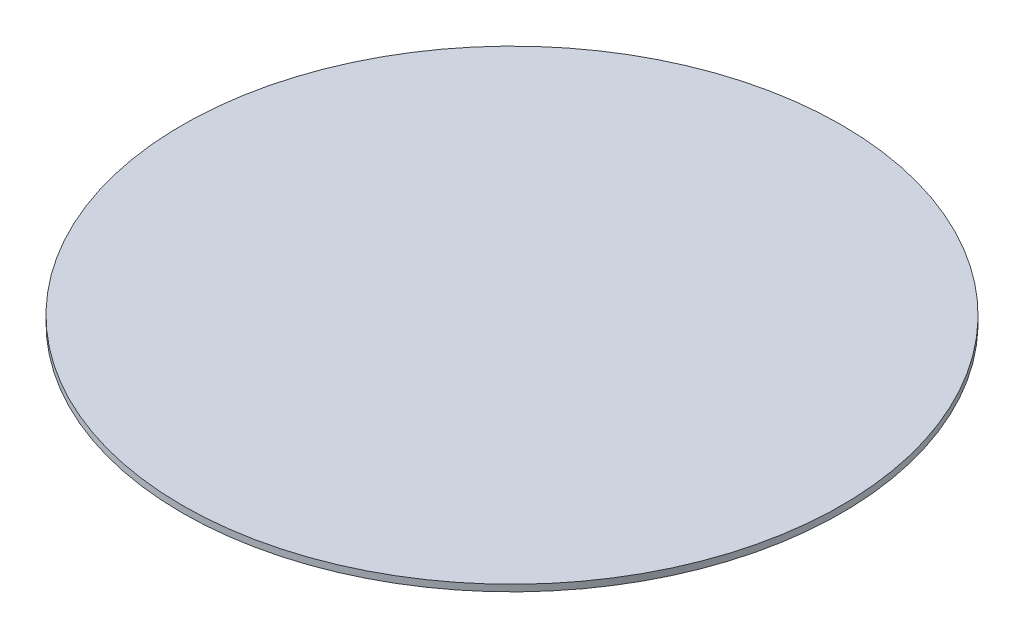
ISO-10303-21;
HEADER;
FILE_DESCRIPTION(('STEP AP214'),'2;1');
FILE_NAME('part.step','',(''),(''),'','','');
FILE_SCHEMA(('AUTOMOTIVE_DESIGN { 1 0 10303 214 1 1 1 1 }'));
ENDSEC;
DATA;
#1=APPLICATION_CONTEXT('core data for automotive mechanical design processes');
#2=APPLICATION_PROTOCOL_DEFINITION('international standard','automotive_design',2000,#1);
#3=PRODUCT_CONTEXT('',#1,'mechanical');
#4=PRODUCT('Part','Part','',(#3));
#5=PRODUCT_RELATED_PRODUCT_CATEGORY('part','',(#4));
#6=PRODUCT_DEFINITION_FORMATION('','',#4);
#7=PRODUCT_DEFINITION_CONTEXT('part definition',#1,'design');
#8=PRODUCT_DEFINITION('design','',#6,#7);
#9=PRODUCT_DEFINITION_SHAPE('','',#8);
#10=(LENGTH_UNIT() NAMED_UNIT(*) SI_UNIT(.MILLI.,.METRE.));
#11=(NAMED_UNIT(*) PLANE_ANGLE_UNIT() SI_UNIT($,.RADIAN.));
#12=(NAMED_UNIT(*) SI_UNIT($,.STERADIAN.) SOLID_ANGLE_UNIT());
#13=UNCERTAINTY_MEASURE_WITH_UNIT(LENGTH_MEASURE(1.E-05),#10,'distance_accuracy_value','');
#14=(GEOMETRIC_REPRESENTATION_CONTEXT(3) GLOBAL_UNCERTAINTY_ASSIGNED_CONTEXT((#13)) GLOBAL_UNIT_ASSIGNED_CONTEXT((#10,
#11,#12)) REPRESENTATION_CONTEXT('',''));
#15=CARTESIAN_POINT('',(0.,0.,0.));
#16=DIRECTION('',(0.,0.,1.));
#17=DIRECTION('',(1.,0.,0.));
#18=AXIS2_PLACEMENT_3D('',#15,#16,#17);
#19=CARTESIAN_POINT('',(0.,1.,-100.));
#20=DIRECTION('',(0.,-1.,0.));
#21=DIRECTION('',(0.,0.,-1.));
#22=AXIS2_PLACEMENT_3D('',#19,#20,#21);
#23=PLANE('',#22);
#24=CARTESIAN_POINT('',(50.,1.,-50.));
#25=DIRECTION('',(0.,1.,0.));
#26=DIRECTION('',(0.,0.,1.));
#27=AXIS2_PLACEMENT_3D('',#24,#25,#26);
#28=CIRCLE('',#27,50.);
#29=CARTESIAN_POINT('',(50.,1.,0.));
#30=VERTEX_POINT('',#29);
#31=EDGE_CURVE('E69',#30,#30,#28,.T.);
#32=ORIENTED_EDGE('',*,*,#31,.T.);
#33=EDGE_LOOP('',(#32));
#34=FACE_BOUND('',#33,.T.);
#35=ADVANCED_FACE('F65',(#34),#23,.F.);
#36=CARTESIAN_POINT('',(0.,0.,-100.));
#37=DIRECTION('',(0.,-1.,0.));
#38=DIRECTION('',(0.,0.,-1.));
#39=AXIS2_PLACEMENT_3D('',#36,#37,#38);
#40=PLANE('',#39);
#41=CARTESIAN_POINT('',(50.,0.,-50.));
#42=DIRECTION('',(0.,1.,0.));
#43=DIRECTION('',(0.,0.,1.));
#44=AXIS2_PLACEMENT_3D('',#41,#42,#43);
#45=CIRCLE('',#44,50.);
#46=CARTESIAN_POINT('',(50.,0.,0.));
#47=VERTEX_POINT('',#46);
#48=EDGE_CURVE('E11',#47,#47,#45,.T.);
#49=ORIENTED_EDGE('',*,*,#48,.F.);
#50=EDGE_LOOP('',(#49));
#51=FACE_BOUND('',#50,.T.);
#52=ADVANCED_FACE('F67',(#51),#40,.T.);
#53=CARTESIAN_POINT('',(50.,0.,-50.));
#54=DIRECTION('',(0.,1.,0.));
#55=DIRECTION('',(0.,0.,1.));
#56=AXIS2_PLACEMENT_3D('',#53,#54,#55);
#57=CYLINDRICAL_SURFACE('',#56,50.);
#58=ORIENTED_EDGE('',*,*,#31,.F.);
#59=EDGE_LOOP('',(#58));
#60=FACE_BOUND('',#59,.T.);
#61=ORIENTED_EDGE('',*,*,#48,.T.);
#62=EDGE_LOOP('',(#61));
#63=FACE_BOUND('',#62,.T.);
#64=ADVANCED_FACE('F79',(#60,#63),#57,.T.);
#65=CLOSED_SHELL('',(#35,#52,#64));
#66=MANIFOLD_SOLID_BREP('B2',#65);
#67=ADVANCED_BREP_SHAPE_REPRESENTATION('',(#18,#66),#14);
#68=SHAPE_DEFINITION_REPRESENTATION(#9,#67);
ENDSEC;
END-ISO-10303-21;
